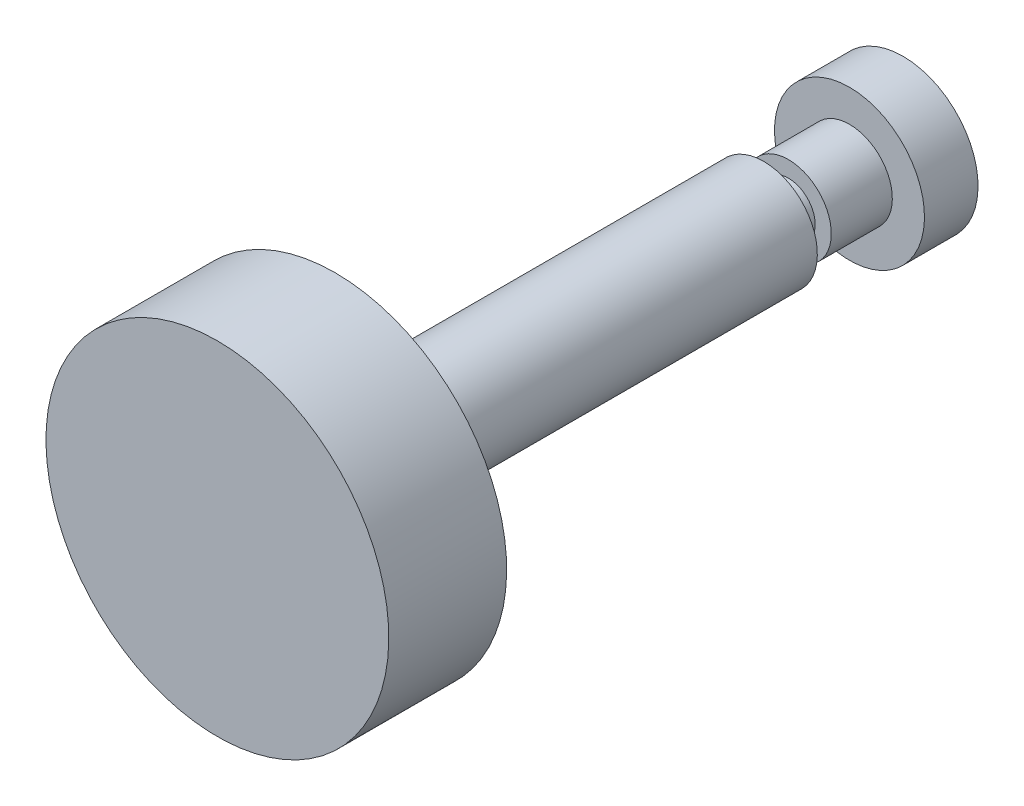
ISO-10303-21;
HEADER;
FILE_DESCRIPTION(('STEP AP214'),'2;1');
FILE_NAME('part.step','',(''),(''),'','','');
FILE_SCHEMA(('AUTOMOTIVE_DESIGN { 1 0 10303 214 1 1 1 1 }'));
ENDSEC;
DATA;
#1=APPLICATION_CONTEXT('core data for automotive mechanical design processes');
#2=APPLICATION_PROTOCOL_DEFINITION('international standard','automotive_design',2000,#1);
#3=PRODUCT_CONTEXT('',#1,'mechanical');
#4=PRODUCT('Part','Part','',(#3));
#5=PRODUCT_RELATED_PRODUCT_CATEGORY('part','',(#4));
#6=PRODUCT_DEFINITION_FORMATION('','',#4);
#7=PRODUCT_DEFINITION_CONTEXT('part definition',#1,'design');
#8=PRODUCT_DEFINITION('design','',#6,#7);
#9=PRODUCT_DEFINITION_SHAPE('','',#8);
#10=(LENGTH_UNIT() NAMED_UNIT(*) SI_UNIT(.MILLI.,.METRE.));
#11=(NAMED_UNIT(*) PLANE_ANGLE_UNIT() SI_UNIT($,.RADIAN.));
#12=(NAMED_UNIT(*) SI_UNIT($,.STERADIAN.) SOLID_ANGLE_UNIT());
#13=UNCERTAINTY_MEASURE_WITH_UNIT(LENGTH_MEASURE(1.E-05),#10,'distance_accuracy_value','');
#14=(GEOMETRIC_REPRESENTATION_CONTEXT(3) GLOBAL_UNCERTAINTY_ASSIGNED_CONTEXT((#13)) GLOBAL_UNIT_ASSIGNED_CONTEXT((#10,
#11,#12)) REPRESENTATION_CONTEXT('',''));
#15=CARTESIAN_POINT('',(0.,0.,0.));
#16=DIRECTION('',(0.,0.,1.));
#17=DIRECTION('',(1.,0.,0.));
#18=AXIS2_PLACEMENT_3D('',#15,#16,#17);
#19=CARTESIAN_POINT('',(0.,0.,0.));
#20=DIRECTION('',(0.,0.,1.));
#21=DIRECTION('',(0.,1.,0.));
#22=AXIS2_PLACEMENT_3D('',#19,#20,#21);
#23=PLANE('',#22);
#24=CARTESIAN_POINT('',(0.,0.,0.));
#25=DIRECTION('',(0.,0.,1.));
#26=DIRECTION('',(0.,1.,0.));
#27=AXIS2_PLACEMENT_3D('',#24,#25,#26);
#28=CIRCLE('',#27,7.);
#29=CARTESIAN_POINT('',(0.,7.,0.));
#30=VERTEX_POINT('',#29);
#31=EDGE_CURVE('E8',#30,#30,#28,.T.);
#32=ORIENTED_EDGE('',*,*,#31,.F.);
#33=EDGE_LOOP('',(#32));
#34=FACE_BOUND('',#33,.T.);
#35=ADVANCED_FACE('F12',(#34),#23,.F.);
#36=CARTESIAN_POINT('',(0.,0.,40.));
#37=DIRECTION('',(0.,0.,1.));
#38=DIRECTION('',(0.,1.,0.));
#39=AXIS2_PLACEMENT_3D('',#36,#37,#38);
#40=CYLINDRICAL_SURFACE('',#39,7.);
#41=CARTESIAN_POINT('',(0.,0.,5.));
#42=DIRECTION('',(0.,0.,1.));
#43=DIRECTION('',(0.,1.,0.));
#44=AXIS2_PLACEMENT_3D('',#41,#42,#43);
#45=CIRCLE('',#44,7.);
#46=CARTESIAN_POINT('',(0.,7.,5.));
#47=VERTEX_POINT('',#46);
#48=EDGE_CURVE('E18',#47,#47,#45,.T.);
#49=ORIENTED_EDGE('',*,*,#48,.F.);
#50=EDGE_LOOP('',(#49));
#51=FACE_BOUND('',#50,.T.);
#52=ORIENTED_EDGE('',*,*,#31,.T.);
#53=EDGE_LOOP('',(#52));
#54=FACE_BOUND('',#53,.T.);
#55=ADVANCED_FACE('F71',(#51,#54),#40,.T.);
#56=CARTESIAN_POINT('',(0.,-7.,5.));
#57=DIRECTION('',(0.,0.,-1.));
#58=DIRECTION('',(0.,-1.,0.));
#59=AXIS2_PLACEMENT_3D('',#56,#57,#58);
#60=PLANE('',#59);
#61=CARTESIAN_POINT('',(0.,0.,5.));
#62=DIRECTION('',(0.,0.,1.));
#63=DIRECTION('',(0.,1.,0.));
#64=AXIS2_PLACEMENT_3D('',#61,#62,#63);
#65=CIRCLE('',#64,4.);
#66=CARTESIAN_POINT('',(0.,4.,5.));
#67=VERTEX_POINT('',#66);
#68=EDGE_CURVE('E22',#67,#67,#65,.T.);
#69=ORIENTED_EDGE('',*,*,#68,.F.);
#70=EDGE_LOOP('',(#69));
#71=FACE_BOUND('',#70,.T.);
#72=ORIENTED_EDGE('',*,*,#48,.T.);
#73=EDGE_LOOP('',(#72));
#74=FACE_BOUND('',#73,.T.);
#75=ADVANCED_FACE('F76',(#71,#74),#60,.F.);
#76=CARTESIAN_POINT('',(0.,0.,40.));
#77=DIRECTION('',(0.,0.,1.));
#78=DIRECTION('',(0.,1.,0.));
#79=AXIS2_PLACEMENT_3D('',#76,#77,#78);
#80=CYLINDRICAL_SURFACE('',#79,4.);
#81=CARTESIAN_POINT('',(0.,0.,10.7));
#82=DIRECTION('',(0.,0.,1.));
#83=DIRECTION('',(0.,1.,0.));
#84=AXIS2_PLACEMENT_3D('',#81,#82,#83);
#85=CIRCLE('',#84,4.);
#86=CARTESIAN_POINT('',(0.,4.,10.7));
#87=VERTEX_POINT('',#86);
#88=EDGE_CURVE('E26',#87,#87,#85,.T.);
#89=ORIENTED_EDGE('',*,*,#88,.F.);
#90=EDGE_LOOP('',(#89));
#91=FACE_BOUND('',#90,.T.);
#92=ORIENTED_EDGE('',*,*,#68,.T.);
#93=EDGE_LOOP('',(#92));
#94=FACE_BOUND('',#93,.T.);
#95=ADVANCED_FACE('F81',(#91,#94),#80,.T.);
#96=CARTESIAN_POINT('',(0.,-4.,10.7));
#97=DIRECTION('',(0.,0.,-1.));
#98=DIRECTION('',(0.,-1.,0.));
#99=AXIS2_PLACEMENT_3D('',#96,#97,#98);
#100=PLANE('',#99);
#101=CARTESIAN_POINT('',(0.,0.,10.7));
#102=DIRECTION('',(0.,0.,1.));
#103=DIRECTION('',(0.,1.,0.));
#104=AXIS2_PLACEMENT_3D('',#101,#102,#103);
#105=CIRCLE('',#104,2.5);
#106=CARTESIAN_POINT('',(0.,2.5,10.7));
#107=VERTEX_POINT('',#106);
#108=EDGE_CURVE('E31',#107,#107,#105,.T.);
#109=ORIENTED_EDGE('',*,*,#108,.F.);
#110=EDGE_LOOP('',(#109));
#111=FACE_BOUND('',#110,.T.);
#112=ORIENTED_EDGE('',*,*,#88,.T.);
#113=EDGE_LOOP('',(#112));
#114=FACE_BOUND('',#113,.T.);
#115=ADVANCED_FACE('F87',(#111,#114),#100,.F.);
#116=CARTESIAN_POINT('',(0.,0.,40.));
#117=DIRECTION('',(0.,0.,1.));
#118=DIRECTION('',(0.,1.,0.));
#119=AXIS2_PLACEMENT_3D('',#116,#117,#118);
#120=CYLINDRICAL_SURFACE('',#119,2.5);
#121=CARTESIAN_POINT('',(0.,0.,13.));
#122=DIRECTION('',(0.,0.,1.));
#123=DIRECTION('',(0.,1.,0.));
#124=AXIS2_PLACEMENT_3D('',#121,#122,#123);
#125=CIRCLE('',#124,2.5);
#126=CARTESIAN_POINT('',(0.,2.5,13.));
#127=VERTEX_POINT('',#126);
#128=EDGE_CURVE('E34',#127,#127,#125,.T.);
#129=ORIENTED_EDGE('',*,*,#128,.F.);
#130=EDGE_LOOP('',(#129));
#131=FACE_BOUND('',#130,.T.);
#132=ORIENTED_EDGE('',*,*,#108,.T.);
#133=EDGE_LOOP('',(#132));
#134=FACE_BOUND('',#133,.T.);
#135=ADVANCED_FACE('F91',(#131,#134),#120,.T.);
#136=CARTESIAN_POINT('',(0.,-2.5,13.));
#137=DIRECTION('',(0.,0.,1.));
#138=DIRECTION('',(0.,1.,0.));
#139=AXIS2_PLACEMENT_3D('',#136,#137,#138);
#140=PLANE('',#139);
#141=CARTESIAN_POINT('',(0.,0.,13.));
#142=DIRECTION('',(0.,0.,1.));
#143=DIRECTION('',(0.,1.,0.));
#144=AXIS2_PLACEMENT_3D('',#141,#142,#143);
#145=CIRCLE('',#144,5.);
#146=CARTESIAN_POINT('',(0.,5.,13.));
#147=VERTEX_POINT('',#146);
#148=EDGE_CURVE('E37',#147,#147,#145,.T.);
#149=ORIENTED_EDGE('',*,*,#148,.F.);
#150=EDGE_LOOP('',(#149));
#151=FACE_BOUND('',#150,.T.);
#152=ORIENTED_EDGE('',*,*,#128,.T.);
#153=EDGE_LOOP('',(#152));
#154=FACE_BOUND('',#153,.T.);
#155=ADVANCED_FACE('F67',(#151,#154),#140,.F.);
#156=CARTESIAN_POINT('',(0.,0.,40.));
#157=DIRECTION('',(0.,0.,1.));
#158=DIRECTION('',(0.,1.,0.));
#159=AXIS2_PLACEMENT_3D('',#156,#157,#158);
#160=CYLINDRICAL_SURFACE('',#159,5.);
#161=CARTESIAN_POINT('',(0.,0.,53.));
#162=DIRECTION('',(0.,0.,1.));
#163=DIRECTION('',(0.,1.,0.));
#164=AXIS2_PLACEMENT_3D('',#161,#162,#163);
#165=CIRCLE('',#164,5.);
#166=CARTESIAN_POINT('',(0.,5.,53.));
#167=VERTEX_POINT('',#166);
#168=EDGE_CURVE('E40',#167,#167,#165,.T.);
#169=ORIENTED_EDGE('',*,*,#168,.F.);
#170=EDGE_LOOP('',(#169));
#171=FACE_BOUND('',#170,.T.);
#172=ORIENTED_EDGE('',*,*,#148,.T.);
#173=EDGE_LOOP('',(#172));
#174=FACE_BOUND('',#173,.T.);
#175=ADVANCED_FACE('F60',(#171,#174),#160,.T.);
#176=CARTESIAN_POINT('',(0.,-16.,53.));
#177=DIRECTION('',(0.,0.,-1.));
#178=DIRECTION('',(0.,-1.,0.));
#179=AXIS2_PLACEMENT_3D('',#176,#177,#178);
#180=PLANE('',#179);
#181=ORIENTED_EDGE('',*,*,#168,.T.);
#182=EDGE_LOOP('',(#181));
#183=FACE_BOUND('',#182,.T.);
#184=CARTESIAN_POINT('',(0.,0.,53.));
#185=DIRECTION('',(0.,0.,1.));
#186=DIRECTION('',(0.,1.,0.));
#187=AXIS2_PLACEMENT_3D('',#184,#185,#186);
#188=CIRCLE('',#187,16.);
#189=CARTESIAN_POINT('',(0.,16.,53.));
#190=VERTEX_POINT('',#189);
#191=EDGE_CURVE('E43',#190,#190,#188,.T.);
#192=ORIENTED_EDGE('',*,*,#191,.F.);
#193=EDGE_LOOP('',(#192));
#194=FACE_BOUND('',#193,.T.);
#195=ADVANCED_FACE('F55',(#183,#194),#180,.T.);
#196=CARTESIAN_POINT('',(0.,0.,40.));
#197=DIRECTION('',(0.,0.,1.));
#198=DIRECTION('',(0.,1.,0.));
#199=AXIS2_PLACEMENT_3D('',#196,#197,#198);
#200=CYLINDRICAL_SURFACE('',#199,16.);
#201=CARTESIAN_POINT('',(0.,0.,64.));
#202=DIRECTION('',(0.,0.,1.));
#203=DIRECTION('',(0.,1.,0.));
#204=AXIS2_PLACEMENT_3D('',#201,#202,#203);
#205=CIRCLE('',#204,16.);
#206=CARTESIAN_POINT('',(0.,16.,64.));
#207=VERTEX_POINT('',#206);
#208=EDGE_CURVE('E46',#207,#207,#205,.T.);
#209=ORIENTED_EDGE('',*,*,#208,.F.);
#210=EDGE_LOOP('',(#209));
#211=FACE_BOUND('',#210,.T.);
#212=ORIENTED_EDGE('',*,*,#191,.T.);
#213=EDGE_LOOP('',(#212));
#214=FACE_BOUND('',#213,.T.);
#215=ADVANCED_FACE('F52',(#211,#214),#200,.T.);
#216=CARTESIAN_POINT('',(0.,-16.,64.));
#217=DIRECTION('',(0.,0.,-1.));
#218=DIRECTION('',(0.,-1.,0.));
#219=AXIS2_PLACEMENT_3D('',#216,#217,#218);
#220=PLANE('',#219);
#221=ORIENTED_EDGE('',*,*,#208,.T.);
#222=EDGE_LOOP('',(#221));
#223=FACE_BOUND('',#222,.T.);
#224=ADVANCED_FACE('F50',(#223),#220,.F.);
#225=CLOSED_SHELL('',(#35,#55,#75,#95,#115,#135,#155,#175,#195,#215,#224));
#226=MANIFOLD_SOLID_BREP('B1',#225);
#227=ADVANCED_BREP_SHAPE_REPRESENTATION('',(#18,#226),#14);
#228=SHAPE_DEFINITION_REPRESENTATION(#9,#227);
ENDSEC;
END-ISO-10303-21;
